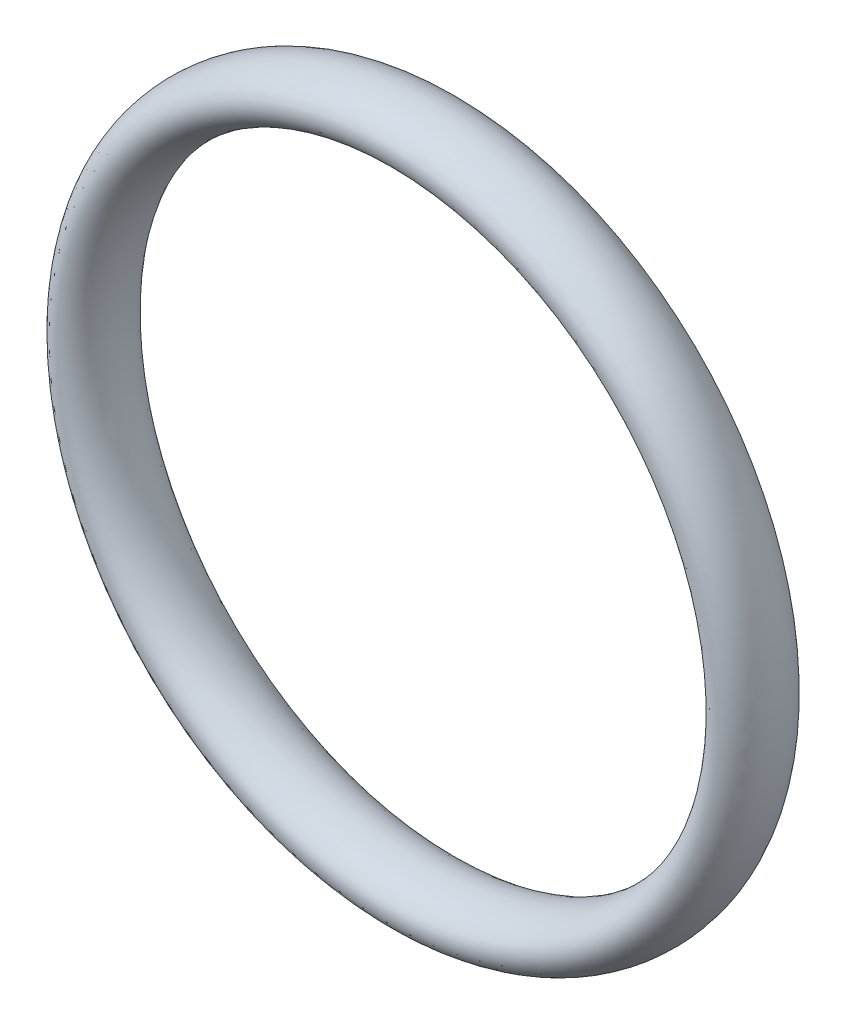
ISO-10303-21;
HEADER;
FILE_DESCRIPTION(('STEP AP214'),'2;1');
FILE_NAME('part.step','',(''),(''),'','','');
FILE_SCHEMA(('AUTOMOTIVE_DESIGN { 1 0 10303 214 1 1 1 1 }'));
ENDSEC;
DATA;
#1=APPLICATION_CONTEXT('core data for automotive mechanical design processes');
#2=APPLICATION_PROTOCOL_DEFINITION('international standard','automotive_design',2000,#1);
#3=PRODUCT_CONTEXT('',#1,'mechanical');
#4=PRODUCT('Part','Part','',(#3));
#5=PRODUCT_RELATED_PRODUCT_CATEGORY('part','',(#4));
#6=PRODUCT_DEFINITION_FORMATION('','',#4);
#7=PRODUCT_DEFINITION_CONTEXT('part definition',#1,'design');
#8=PRODUCT_DEFINITION('design','',#6,#7);
#9=PRODUCT_DEFINITION_SHAPE('','',#8);
#10=(LENGTH_UNIT() NAMED_UNIT(*) SI_UNIT(.MILLI.,.METRE.));
#11=(NAMED_UNIT(*) PLANE_ANGLE_UNIT() SI_UNIT($,.RADIAN.));
#12=(NAMED_UNIT(*) SI_UNIT($,.STERADIAN.) SOLID_ANGLE_UNIT());
#13=UNCERTAINTY_MEASURE_WITH_UNIT(LENGTH_MEASURE(1.E-05),#10,'distance_accuracy_value','');
#14=(GEOMETRIC_REPRESENTATION_CONTEXT(3) GLOBAL_UNCERTAINTY_ASSIGNED_CONTEXT((#13)) GLOBAL_UNIT_ASSIGNED_CONTEXT((#10,
#11,#12)) REPRESENTATION_CONTEXT('',''));
#15=CARTESIAN_POINT('',(0.,0.,0.));
#16=DIRECTION('',(0.,0.,1.));
#17=DIRECTION('',(1.,0.,0.));
#18=AXIS2_PLACEMENT_3D('',#15,#16,#17);
#19=CARTESIAN_POINT('',(0.,11.575,-1.35));
#20=DIRECTION('',(1.,0.,0.));
#21=DIRECTION('',(0.,0.,-1.));
#22=AXIS2_PLACEMENT_3D('',#19,#20,#21);
#23=ELLIPSE('',#22,1.35,0.925);
#24=CARTESIAN_POINT('',(0.,0.,0.));
#25=DIRECTION('',(0.,0.,1.));
#26=AXIS1_PLACEMENT('',#24,#25);
#27=SURFACE_OF_REVOLUTION('',#23,#26);
#28=ADVANCED_FACE('F28',(),#27,.T.);
#29=CLOSED_SHELL('',(#28));
#30=MANIFOLD_SOLID_BREP('B2',#29);
#31=ADVANCED_BREP_SHAPE_REPRESENTATION('',(#18,#30),#14);
#32=SHAPE_DEFINITION_REPRESENTATION(#9,#31);
ENDSEC;
END-ISO-10303-21;
